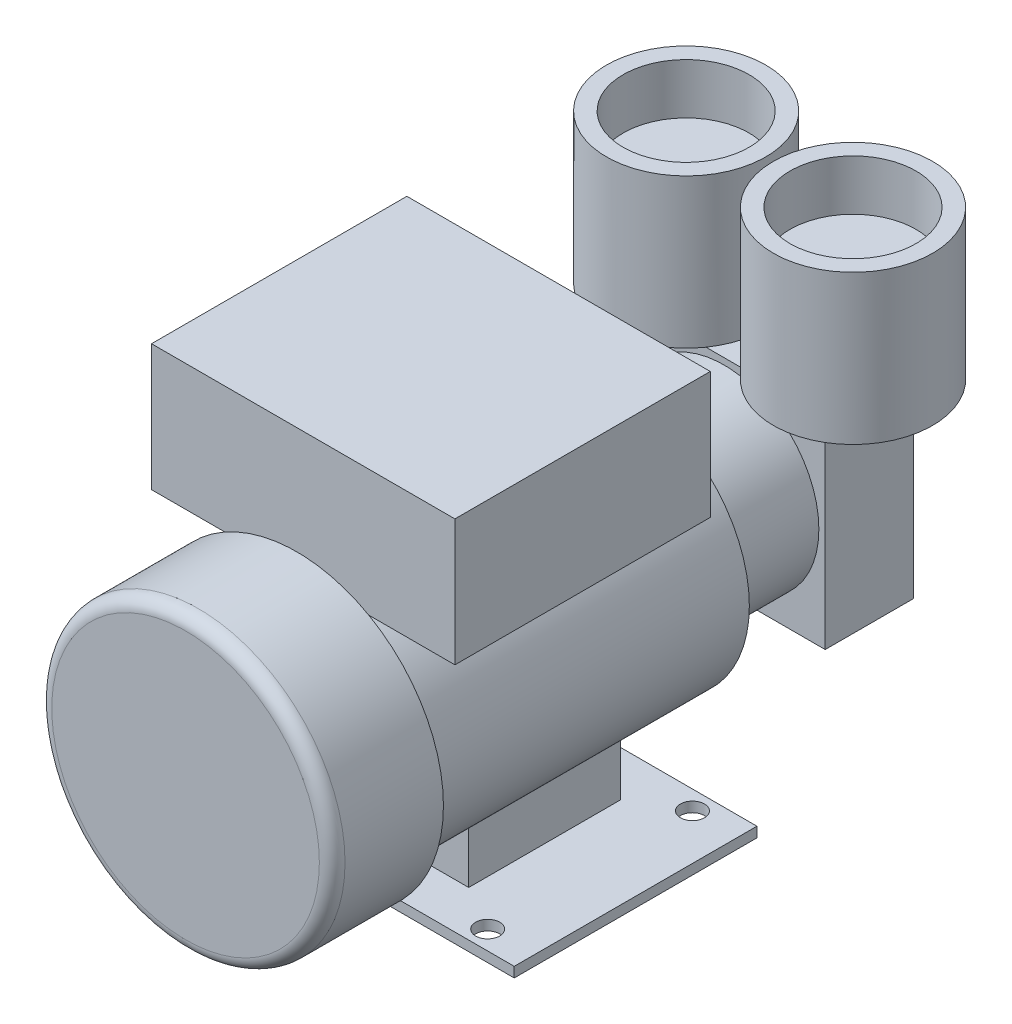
ISO-10303-21;
HEADER;
FILE_DESCRIPTION(('STEP AP214'),'2;1');
FILE_NAME('part.step','',(''),(''),'','','');
FILE_SCHEMA(('AUTOMOTIVE_DESIGN { 1 0 10303 214 1 1 1 1 }'));
ENDSEC;
DATA;
#1=APPLICATION_CONTEXT('core data for automotive mechanical design processes');
#2=APPLICATION_PROTOCOL_DEFINITION('international standard','automotive_design',2000,#1);
#3=PRODUCT_CONTEXT('',#1,'mechanical');
#4=PRODUCT('Part','Part','',(#3));
#5=PRODUCT_RELATED_PRODUCT_CATEGORY('part','',(#4));
#6=PRODUCT_DEFINITION_FORMATION('','',#4);
#7=PRODUCT_DEFINITION_CONTEXT('part definition',#1,'design');
#8=PRODUCT_DEFINITION('design','',#6,#7);
#9=PRODUCT_DEFINITION_SHAPE('','',#8);
#10=(LENGTH_UNIT() NAMED_UNIT(*) SI_UNIT(.MILLI.,.METRE.));
#11=(NAMED_UNIT(*) PLANE_ANGLE_UNIT() SI_UNIT($,.RADIAN.));
#12=(NAMED_UNIT(*) SI_UNIT($,.STERADIAN.) SOLID_ANGLE_UNIT());
#13=UNCERTAINTY_MEASURE_WITH_UNIT(LENGTH_MEASURE(1.E-05),#10,'distance_accuracy_value','');
#14=(GEOMETRIC_REPRESENTATION_CONTEXT(3) GLOBAL_UNCERTAINTY_ASSIGNED_CONTEXT((#13)) GLOBAL_UNIT_ASSIGNED_CONTEXT((#10,
#11,#12)) REPRESENTATION_CONTEXT('',''));
#15=CARTESIAN_POINT('',(0.,0.,0.));
#16=DIRECTION('',(0.,0.,1.));
#17=DIRECTION('',(1.,0.,0.));
#18=AXIS2_PLACEMENT_3D('',#15,#16,#17);
#19=CARTESIAN_POINT('',(40.,40.,-204.));
#20=DIRECTION('',(0.,-1.,0.));
#21=DIRECTION('',(0.,0.,-1.));
#22=AXIS2_PLACEMENT_3D('',#19,#20,#21);
#23=PLANE('',#22);
#24=CARTESIAN_POINT('',(-33.,40.,-187.));
#25=DIRECTION('',(0.,1.,0.));
#26=DIRECTION('',(0.,0.,-1.));
#27=AXIS2_PLACEMENT_3D('',#24,#25,#26);
#28=CIRCLE('',#27,31.5);
#29=CARTESIAN_POINT('',(-7.14946809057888,40.,-169.));
#30=VERTEX_POINT('',#29);
#31=CARTESIAN_POINT('',(-6.48113878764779,40.,-204.));
#32=VERTEX_POINT('',#31);
#33=EDGE_CURVE('E48',#30,#32,#28,.T.);
#34=ORIENTED_EDGE('',*,*,#33,.F.);
#35=DIRECTION('',(1.,0.,0.));
#36=VECTOR('',#35,1.);
#37=CARTESIAN_POINT('',(40.,40.,-169.));
#38=LINE('',#37,#36);
#39=CARTESIAN_POINT('',(7.14946809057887,40.,-169.));
#40=VERTEX_POINT('',#39);
#41=EDGE_CURVE('E182',#30,#40,#38,.T.);
#42=ORIENTED_EDGE('',*,*,#41,.T.);
#43=CARTESIAN_POINT('',(33.,40.,-187.));
#44=DIRECTION('',(0.,1.,0.));
#45=DIRECTION('',(0.,0.,1.));
#46=AXIS2_PLACEMENT_3D('',#43,#44,#45);
#47=CIRCLE('',#46,31.5);
#48=CARTESIAN_POINT('',(6.48113878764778,40.,-204.));
#49=VERTEX_POINT('',#48);
#50=EDGE_CURVE('E508',#49,#40,#47,.T.);
#51=ORIENTED_EDGE('',*,*,#50,.F.);
#52=DIRECTION('',(1.,0.,0.));
#53=VECTOR('',#52,1.);
#54=CARTESIAN_POINT('',(40.,40.,-204.));
#55=LINE('',#54,#53);
#56=EDGE_CURVE('E56',#32,#49,#55,.T.);
#57=ORIENTED_EDGE('',*,*,#56,.F.);
#58=EDGE_LOOP('',(#34,#42,#51,#57));
#59=FACE_BOUND('',#58,.T.);
#60=ADVANCED_FACE('F34',(#59),#23,.F.);
#61=CARTESIAN_POINT('',(66.,-61.,-116.));
#62=DIRECTION('',(0.,-1.,0.));
#63=DIRECTION('',(0.,0.,-1.));
#64=AXIS2_PLACEMENT_3D('',#61,#62,#63);
#65=PLANE('',#64);
#66=CARTESIAN_POINT('',(-48.,-61.,-27.4999999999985));
#67=DIRECTION('',(0.,1.,0.));
#68=DIRECTION('',(0.,0.,1.));
#69=AXIS2_PLACEMENT_3D('',#66,#67,#68);
#70=CIRCLE('',#69,4.75);
#71=CARTESIAN_POINT('',(-48.,-61.,-22.7499999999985));
#72=VERTEX_POINT('',#71);
#73=EDGE_CURVE('E310',#72,#72,#70,.T.);
#74=ORIENTED_EDGE('',*,*,#73,.F.);
#75=EDGE_LOOP('',(#74));
#76=FACE_BOUND('',#75,.T.);
#77=CARTESIAN_POINT('',(-48.,-61.,-108.499999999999));
#78=DIRECTION('',(0.,1.,0.));
#79=DIRECTION('',(0.,0.,1.));
#80=AXIS2_PLACEMENT_3D('',#77,#78,#79);
#81=CIRCLE('',#80,4.75);
#82=CARTESIAN_POINT('',(-48.,-61.,-103.749999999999));
#83=VERTEX_POINT('',#82);
#84=EDGE_CURVE('E322',#83,#83,#81,.T.);
#85=ORIENTED_EDGE('',*,*,#84,.F.);
#86=EDGE_LOOP('',(#85));
#87=FACE_BOUND('',#86,.T.);
#88=DIRECTION('',(0.,0.,-1.));
#89=VECTOR('',#88,1.);
#90=CARTESIAN_POINT('',(66.,-61.,-20.));
#91=LINE('',#90,#89);
#92=CARTESIAN_POINT('',(66.,-61.,-20.));
#93=VERTEX_POINT('',#92);
#94=CARTESIAN_POINT('',(66.,-61.,-116.));
#95=VERTEX_POINT('',#94);
#96=EDGE_CURVE('E334',#93,#95,#91,.T.);
#97=ORIENTED_EDGE('',*,*,#96,.T.);
#98=DIRECTION('',(-1.,0.,0.));
#99=VECTOR('',#98,1.);
#100=CARTESIAN_POINT('',(-66.0000000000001,-61.,-116.));
#101=LINE('',#100,#99);
#102=CARTESIAN_POINT('',(-66.0000000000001,-61.,-116.));
#103=VERTEX_POINT('',#102);
#104=EDGE_CURVE('E337',#95,#103,#101,.T.);
#105=ORIENTED_EDGE('',*,*,#104,.T.);
#106=DIRECTION('',(0.,0.,1.));
#107=VECTOR('',#106,1.);
#108=CARTESIAN_POINT('',(-66.,-61.,-20.));
#109=LINE('',#108,#107);
#110=CARTESIAN_POINT('',(-66.,-61.,-20.));
#111=VERTEX_POINT('',#110);
#112=EDGE_CURVE('E340',#103,#111,#109,.T.);
#113=ORIENTED_EDGE('',*,*,#112,.T.);
#114=DIRECTION('',(1.,0.,0.));
#115=VECTOR('',#114,1.);
#116=CARTESIAN_POINT('',(-66.,-61.,-20.));
#117=LINE('',#116,#115);
#118=EDGE_CURVE('E342',#111,#93,#117,.T.);
#119=ORIENTED_EDGE('',*,*,#118,.T.);
#120=EDGE_LOOP('',(#97,#105,#113,#119));
#121=FACE_BOUND('',#120,.T.);
#122=CARTESIAN_POINT('',(48.,-61.,-108.5));
#123=DIRECTION('',(0.,1.,0.));
#124=DIRECTION('',(0.,0.,1.));
#125=AXIS2_PLACEMENT_3D('',#122,#123,#124);
#126=CIRCLE('',#125,4.75);
#127=CARTESIAN_POINT('',(48.,-61.,-103.75));
#128=VERTEX_POINT('',#127);
#129=EDGE_CURVE('E328',#128,#128,#126,.T.);
#130=ORIENTED_EDGE('',*,*,#129,.F.);
#131=EDGE_LOOP('',(#130));
#132=FACE_BOUND('',#131,.T.);
#133=CARTESIAN_POINT('',(48.,-61.,-27.5));
#134=DIRECTION('',(0.,1.,0.));
#135=DIRECTION('',(0.,0.,1.));
#136=AXIS2_PLACEMENT_3D('',#133,#134,#135);
#137=CIRCLE('',#136,4.75);
#138=CARTESIAN_POINT('',(48.,-61.,-22.75));
#139=VERTEX_POINT('',#138);
#140=EDGE_CURVE('E316',#139,#139,#137,.T.);
#141=ORIENTED_EDGE('',*,*,#140,.F.);
#142=EDGE_LOOP('',(#141));
#143=FACE_BOUND('',#142,.T.);
#144=DIRECTION('',(0.,0.,-1.));
#145=VECTOR('',#144,1.);
#146=CARTESIAN_POINT('',(30.,-61.,-98.));
#147=LINE('',#146,#145);
#148=CARTESIAN_POINT('',(30.,-61.,-38.));
#149=VERTEX_POINT('',#148);
#150=CARTESIAN_POINT('',(30.,-61.,-98.));
#151=VERTEX_POINT('',#150);
#152=EDGE_CURVE('E289',#149,#151,#147,.T.);
#153=ORIENTED_EDGE('',*,*,#152,.F.);
#154=DIRECTION('',(1.,0.,0.));
#155=VECTOR('',#154,1.);
#156=CARTESIAN_POINT('',(-30.,-61.,-38.));
#157=LINE('',#156,#155);
#158=CARTESIAN_POINT('',(-30.,-61.,-38.));
#159=VERTEX_POINT('',#158);
#160=EDGE_CURVE('E298',#159,#149,#157,.T.);
#161=ORIENTED_EDGE('',*,*,#160,.F.);
#162=DIRECTION('',(0.,0.,1.));
#163=VECTOR('',#162,1.);
#164=CARTESIAN_POINT('',(-30.,-61.,-98.));
#165=LINE('',#164,#163);
#166=CARTESIAN_POINT('',(-30.,-61.,-98.));
#167=VERTEX_POINT('',#166);
#168=EDGE_CURVE('E295',#167,#159,#165,.T.);
#169=ORIENTED_EDGE('',*,*,#168,.F.);
#170=DIRECTION('',(-1.,0.,0.));
#171=VECTOR('',#170,1.);
#172=CARTESIAN_POINT('',(-30.,-61.,-98.));
#173=LINE('',#172,#171);
#174=EDGE_CURVE('E292',#151,#167,#173,.T.);
#175=ORIENTED_EDGE('',*,*,#174,.F.);
#176=EDGE_LOOP('',(#153,#161,#169,#175));
#177=FACE_BOUND('',#176,.T.);
#178=ADVANCED_FACE('F381',(#76,#87,#121,#132,#143,#177),#65,.F.);
#179=CARTESIAN_POINT('',(66.,-65.,-116.));
#180=DIRECTION('',(0.,-1.,0.));
#181=DIRECTION('',(0.,0.,-1.));
#182=AXIS2_PLACEMENT_3D('',#179,#180,#181);
#183=PLANE('',#182);
#184=CARTESIAN_POINT('',(48.,-65.,-27.5));
#185=DIRECTION('',(0.,1.,0.));
#186=DIRECTION('',(0.,0.,1.));
#187=AXIS2_PLACEMENT_3D('',#184,#185,#186);
#188=CIRCLE('',#187,4.75);
#189=CARTESIAN_POINT('',(48.,-65.,-22.75));
#190=VERTEX_POINT('',#189);
#191=EDGE_CURVE('E313',#190,#190,#188,.T.);
#192=ORIENTED_EDGE('',*,*,#191,.T.);
#193=EDGE_LOOP('',(#192));
#194=FACE_BOUND('',#193,.T.);
#195=CARTESIAN_POINT('',(48.,-65.,-108.5));
#196=DIRECTION('',(0.,1.,0.));
#197=DIRECTION('',(0.,0.,1.));
#198=AXIS2_PLACEMENT_3D('',#195,#196,#197);
#199=CIRCLE('',#198,4.75);
#200=CARTESIAN_POINT('',(48.,-65.,-103.75));
#201=VERTEX_POINT('',#200);
#202=EDGE_CURVE('E325',#201,#201,#199,.T.);
#203=ORIENTED_EDGE('',*,*,#202,.T.);
#204=EDGE_LOOP('',(#203));
#205=FACE_BOUND('',#204,.T.);
#206=DIRECTION('',(0.,0.,-1.));
#207=VECTOR('',#206,1.);
#208=CARTESIAN_POINT('',(66.,-65.,-20.));
#209=LINE('',#208,#207);
#210=CARTESIAN_POINT('',(66.,-65.,-20.));
#211=VERTEX_POINT('',#210);
#212=CARTESIAN_POINT('',(66.,-65.,-116.));
#213=VERTEX_POINT('',#212);
#214=EDGE_CURVE('E331',#211,#213,#209,.T.);
#215=ORIENTED_EDGE('',*,*,#214,.F.);
#216=DIRECTION('',(1.,0.,0.));
#217=VECTOR('',#216,1.);
#218=CARTESIAN_POINT('',(-66.,-65.,-20.));
#219=LINE('',#218,#217);
#220=CARTESIAN_POINT('',(-66.,-65.,-20.));
#221=VERTEX_POINT('',#220);
#222=EDGE_CURVE('E338',#221,#211,#219,.T.);
#223=ORIENTED_EDGE('',*,*,#222,.F.);
#224=DIRECTION('',(0.,0.,1.));
#225=VECTOR('',#224,1.);
#226=CARTESIAN_POINT('',(-66.,-65.,-20.));
#227=LINE('',#226,#225);
#228=CARTESIAN_POINT('',(-66.0000000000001,-65.,-116.));
#229=VERTEX_POINT('',#228);
#230=EDGE_CURVE('E349',#229,#221,#227,.T.);
#231=ORIENTED_EDGE('',*,*,#230,.F.);
#232=DIRECTION('',(-1.,0.,0.));
#233=VECTOR('',#232,1.);
#234=CARTESIAN_POINT('',(-66.0000000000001,-65.,-116.));
#235=LINE('',#234,#233);
#236=EDGE_CURVE('E347',#213,#229,#235,.T.);
#237=ORIENTED_EDGE('',*,*,#236,.F.);
#238=EDGE_LOOP('',(#215,#223,#231,#237));
#239=FACE_BOUND('',#238,.T.);
#240=CARTESIAN_POINT('',(-48.,-65.,-108.499999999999));
#241=DIRECTION('',(0.,1.,0.));
#242=DIRECTION('',(0.,0.,1.));
#243=AXIS2_PLACEMENT_3D('',#240,#241,#242);
#244=CIRCLE('',#243,4.75);
#245=CARTESIAN_POINT('',(-48.,-65.,-103.749999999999));
#246=VERTEX_POINT('',#245);
#247=EDGE_CURVE('E319',#246,#246,#244,.T.);
#248=ORIENTED_EDGE('',*,*,#247,.T.);
#249=EDGE_LOOP('',(#248));
#250=FACE_BOUND('',#249,.T.);
#251=CARTESIAN_POINT('',(-48.,-65.,-27.4999999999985));
#252=DIRECTION('',(0.,1.,0.));
#253=DIRECTION('',(0.,0.,1.));
#254=AXIS2_PLACEMENT_3D('',#251,#252,#253);
#255=CIRCLE('',#254,4.75);
#256=CARTESIAN_POINT('',(-48.,-65.,-22.7499999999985));
#257=VERTEX_POINT('',#256);
#258=EDGE_CURVE('E309',#257,#257,#255,.T.);
#259=ORIENTED_EDGE('',*,*,#258,.T.);
#260=EDGE_LOOP('',(#259));
#261=FACE_BOUND('',#260,.T.);
#262=ADVANCED_FACE('F370',(#194,#205,#239,#250,#261),#183,.T.);
#263=CARTESIAN_POINT('',(66.,-61.,-20.));
#264=DIRECTION('',(-1.,0.,0.));
#265=DIRECTION('',(0.,0.,1.));
#266=AXIS2_PLACEMENT_3D('',#263,#264,#265);
#267=PLANE('',#266);
#268=ORIENTED_EDGE('',*,*,#214,.T.);
#269=DIRECTION('',(0.,-1.,0.));
#270=VECTOR('',#269,1.);
#271=CARTESIAN_POINT('',(66.,-61.,-116.));
#272=LINE('',#271,#270);
#273=EDGE_CURVE('E42',#95,#213,#272,.T.);
#274=ORIENTED_EDGE('',*,*,#273,.F.);
#275=ORIENTED_EDGE('',*,*,#96,.F.);
#276=DIRECTION('',(0.,-1.,0.));
#277=VECTOR('',#276,1.);
#278=CARTESIAN_POINT('',(66.,-61.,-20.));
#279=LINE('',#278,#277);
#280=EDGE_CURVE('E344',#93,#211,#279,.T.);
#281=ORIENTED_EDGE('',*,*,#280,.T.);
#282=EDGE_LOOP('',(#268,#274,#275,#281));
#283=FACE_BOUND('',#282,.T.);
#284=ADVANCED_FACE('F36',(#283),#267,.F.);
#285=CARTESIAN_POINT('',(-66.0000000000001,-61.,-116.));
#286=DIRECTION('',(0.,0.,1.));
#287=DIRECTION('',(1.,0.,0.));
#288=AXIS2_PLACEMENT_3D('',#285,#286,#287);
#289=PLANE('',#288);
#290=ORIENTED_EDGE('',*,*,#236,.T.);
#291=DIRECTION('',(0.,-1.,0.));
#292=VECTOR('',#291,1.);
#293=CARTESIAN_POINT('',(-66.0000000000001,-61.,-116.));
#294=LINE('',#293,#292);
#295=EDGE_CURVE('E357',#103,#229,#294,.T.);
#296=ORIENTED_EDGE('',*,*,#295,.F.);
#297=ORIENTED_EDGE('',*,*,#104,.F.);
#298=ORIENTED_EDGE('',*,*,#273,.T.);
#299=EDGE_LOOP('',(#290,#296,#297,#298));
#300=FACE_BOUND('',#299,.T.);
#301=ADVANCED_FACE('F362',(#300),#289,.F.);
#302=CARTESIAN_POINT('',(-66.,-61.,-20.));
#303=DIRECTION('',(1.,0.,0.));
#304=DIRECTION('',(0.,0.,-1.));
#305=AXIS2_PLACEMENT_3D('',#302,#303,#304);
#306=PLANE('',#305);
#307=ORIENTED_EDGE('',*,*,#230,.T.);
#308=DIRECTION('',(0.,-1.,0.));
#309=VECTOR('',#308,1.);
#310=CARTESIAN_POINT('',(-66.,-61.,-20.));
#311=LINE('',#310,#309);
#312=EDGE_CURVE('E354',#111,#221,#311,.T.);
#313=ORIENTED_EDGE('',*,*,#312,.F.);
#314=ORIENTED_EDGE('',*,*,#112,.F.);
#315=ORIENTED_EDGE('',*,*,#295,.T.);
#316=EDGE_LOOP('',(#307,#313,#314,#315));
#317=FACE_BOUND('',#316,.T.);
#318=ADVANCED_FACE('F375',(#317),#306,.F.);
#319=CARTESIAN_POINT('',(-66.,-61.,-20.));
#320=DIRECTION('',(0.,0.,-1.));
#321=DIRECTION('',(-1.,0.,0.));
#322=AXIS2_PLACEMENT_3D('',#319,#320,#321);
#323=PLANE('',#322);
#324=ORIENTED_EDGE('',*,*,#222,.T.);
#325=ORIENTED_EDGE('',*,*,#280,.F.);
#326=ORIENTED_EDGE('',*,*,#118,.F.);
#327=ORIENTED_EDGE('',*,*,#312,.T.);
#328=EDGE_LOOP('',(#324,#325,#326,#327));
#329=FACE_BOUND('',#328,.T.);
#330=ADVANCED_FACE('F379',(#329),#323,.F.);
#331=CARTESIAN_POINT('',(48.,-61.,-108.5));
#332=DIRECTION('',(0.,-1.,0.));
#333=DIRECTION('',(0.,0.,-1.));
#334=AXIS2_PLACEMENT_3D('',#331,#332,#333);
#335=CYLINDRICAL_SURFACE('',#334,4.75);
#336=ORIENTED_EDGE('',*,*,#129,.T.);
#337=EDGE_LOOP('',(#336));
#338=FACE_BOUND('',#337,.T.);
#339=ORIENTED_EDGE('',*,*,#202,.F.);
#340=EDGE_LOOP('',(#339));
#341=FACE_BOUND('',#340,.T.);
#342=ADVANCED_FACE('F795',(#338,#341),#335,.F.);
#343=CARTESIAN_POINT('',(-48.,-61.,-108.499999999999));
#344=DIRECTION('',(0.,-1.,0.));
#345=DIRECTION('',(0.,0.,-1.));
#346=AXIS2_PLACEMENT_3D('',#343,#344,#345);
#347=CYLINDRICAL_SURFACE('',#346,4.75);
#348=ORIENTED_EDGE('',*,*,#84,.T.);
#349=EDGE_LOOP('',(#348));
#350=FACE_BOUND('',#349,.T.);
#351=ORIENTED_EDGE('',*,*,#247,.F.);
#352=EDGE_LOOP('',(#351));
#353=FACE_BOUND('',#352,.T.);
#354=ADVANCED_FACE('F786',(#350,#353),#347,.F.);
#355=CARTESIAN_POINT('',(48.,-61.,-27.5));
#356=DIRECTION('',(0.,-1.,0.));
#357=DIRECTION('',(0.,0.,-1.));
#358=AXIS2_PLACEMENT_3D('',#355,#356,#357);
#359=CYLINDRICAL_SURFACE('',#358,4.75);
#360=ORIENTED_EDGE('',*,*,#140,.T.);
#361=EDGE_LOOP('',(#360));
#362=FACE_BOUND('',#361,.T.);
#363=ORIENTED_EDGE('',*,*,#191,.F.);
#364=EDGE_LOOP('',(#363));
#365=FACE_BOUND('',#364,.T.);
#366=ADVANCED_FACE('F777',(#362,#365),#359,.F.);
#367=CARTESIAN_POINT('',(-48.,-61.,-27.4999999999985));
#368=DIRECTION('',(0.,-1.,0.));
#369=DIRECTION('',(0.,0.,-1.));
#370=AXIS2_PLACEMENT_3D('',#367,#368,#369);
#371=CYLINDRICAL_SURFACE('',#370,4.75);
#372=ORIENTED_EDGE('',*,*,#73,.T.);
#373=EDGE_LOOP('',(#372));
#374=FACE_BOUND('',#373,.T.);
#375=ORIENTED_EDGE('',*,*,#258,.F.);
#376=EDGE_LOOP('',(#375));
#377=FACE_BOUND('',#376,.T.);
#378=ADVANCED_FACE('F672',(#374,#377),#371,.F.);
#379=CARTESIAN_POINT('',(30.,-36.,-98.));
#380=DIRECTION('',(-1.,0.,0.));
#381=DIRECTION('',(0.,0.,1.));
#382=AXIS2_PLACEMENT_3D('',#379,#380,#381);
#383=PLANE('',#382);
#384=DIRECTION('',(0.,-1.,0.));
#385=VECTOR('',#384,1.);
#386=CARTESIAN_POINT('',(30.,-36.,-98.));
#387=LINE('',#386,#385);
#388=CARTESIAN_POINT('',(30.,-40.,-98.));
#389=VERTEX_POINT('',#388);
#390=EDGE_CURVE('E307',#389,#151,#387,.T.);
#391=ORIENTED_EDGE('',*,*,#390,.F.);
#392=DIRECTION('',(0.,0.,1.));
#393=VECTOR('',#392,1.);
#394=CARTESIAN_POINT('',(30.,-40.,-129.));
#395=LINE('',#394,#393);
#396=CARTESIAN_POINT('',(30.,-40.,-38.));
#397=VERTEX_POINT('',#396);
#398=EDGE_CURVE('E286',#389,#397,#395,.T.);
#399=ORIENTED_EDGE('',*,*,#398,.T.);
#400=DIRECTION('',(0.,-1.,0.));
#401=VECTOR('',#400,1.);
#402=CARTESIAN_POINT('',(30.,-36.,-38.));
#403=LINE('',#402,#401);
#404=EDGE_CURVE('E301',#397,#149,#403,.T.);
#405=ORIENTED_EDGE('',*,*,#404,.T.);
#406=ORIENTED_EDGE('',*,*,#152,.T.);
#407=EDGE_LOOP('',(#391,#399,#405,#406));
#408=FACE_BOUND('',#407,.T.);
#409=ADVANCED_FACE('F405',(#408),#383,.F.);
#410=CARTESIAN_POINT('',(-30.,-36.,-98.));
#411=DIRECTION('',(0.,0.,1.));
#412=DIRECTION('',(1.,0.,0.));
#413=AXIS2_PLACEMENT_3D('',#410,#411,#412);
#414=PLANE('',#413);
#415=DIRECTION('',(0.,-1.,0.));
#416=VECTOR('',#415,1.);
#417=CARTESIAN_POINT('',(-30.,-36.,-98.));
#418=LINE('',#417,#416);
#419=CARTESIAN_POINT('',(-30.,-40.,-98.));
#420=VERTEX_POINT('',#419);
#421=EDGE_CURVE('E305',#420,#167,#418,.T.);
#422=ORIENTED_EDGE('',*,*,#421,.F.);
#423=CARTESIAN_POINT('',(0.,0.,-98.));
#424=DIRECTION('',(0.,0.,1.));
#425=DIRECTION('',(1.,0.,0.));
#426=AXIS2_PLACEMENT_3D('',#423,#424,#425);
#427=CIRCLE('',#426,50.);
#428=EDGE_CURVE('E283',#420,#389,#427,.T.);
#429=ORIENTED_EDGE('',*,*,#428,.T.);
#430=ORIENTED_EDGE('',*,*,#390,.T.);
#431=ORIENTED_EDGE('',*,*,#174,.T.);
#432=EDGE_LOOP('',(#422,#429,#430,#431));
#433=FACE_BOUND('',#432,.T.);
#434=ADVANCED_FACE('F404',(#433),#414,.F.);
#435=CARTESIAN_POINT('',(-30.,-36.,-98.));
#436=DIRECTION('',(1.,0.,0.));
#437=DIRECTION('',(0.,0.,-1.));
#438=AXIS2_PLACEMENT_3D('',#435,#436,#437);
#439=PLANE('',#438);
#440=DIRECTION('',(0.,-1.,0.));
#441=VECTOR('',#440,1.);
#442=CARTESIAN_POINT('',(-30.,-36.,-38.));
#443=LINE('',#442,#441);
#444=CARTESIAN_POINT('',(-30.,-40.,-38.));
#445=VERTEX_POINT('',#444);
#446=EDGE_CURVE('E303',#445,#159,#443,.T.);
#447=ORIENTED_EDGE('',*,*,#446,.F.);
#448=DIRECTION('',(0.,0.,1.));
#449=VECTOR('',#448,1.);
#450=CARTESIAN_POINT('',(-30.,-40.,-129.));
#451=LINE('',#450,#449);
#452=EDGE_CURVE('E280',#445,#420,#451,.F.);
#453=ORIENTED_EDGE('',*,*,#452,.T.);
#454=ORIENTED_EDGE('',*,*,#421,.T.);
#455=ORIENTED_EDGE('',*,*,#168,.T.);
#456=EDGE_LOOP('',(#447,#453,#454,#455));
#457=FACE_BOUND('',#456,.T.);
#458=ADVANCED_FACE('F401',(#457),#439,.F.);
#459=CARTESIAN_POINT('',(-30.,-36.,-38.));
#460=DIRECTION('',(0.,0.,-1.));
#461=DIRECTION('',(-1.,0.,0.));
#462=AXIS2_PLACEMENT_3D('',#459,#460,#461);
#463=PLANE('',#462);
#464=ORIENTED_EDGE('',*,*,#404,.F.);
#465=CARTESIAN_POINT('',(0.,0.,-38.));
#466=DIRECTION('',(0.,0.,-1.));
#467=DIRECTION('',(-1.,0.,0.));
#468=AXIS2_PLACEMENT_3D('',#465,#466,#467);
#469=CIRCLE('',#468,50.);
#470=EDGE_CURVE('E11',#397,#445,#469,.T.);
#471=ORIENTED_EDGE('',*,*,#470,.T.);
#472=ORIENTED_EDGE('',*,*,#446,.T.);
#473=ORIENTED_EDGE('',*,*,#160,.T.);
#474=EDGE_LOOP('',(#464,#471,#472,#473));
#475=FACE_BOUND('',#474,.T.);
#476=ADVANCED_FACE('F398',(#475),#463,.F.);
#477=CARTESIAN_POINT('',(0.,0.,-129.));
#478=DIRECTION('',(0.,0.,1.));
#479=DIRECTION('',(1.,0.,0.));
#480=AXIS2_PLACEMENT_3D('',#477,#478,#479);
#481=CYLINDRICAL_SURFACE('',#480,50.);
#482=CARTESIAN_POINT('',(0.,0.,-2.53999999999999));
#483=DIRECTION('',(0.,0.,-1.));
#484=DIRECTION('',(-1.,0.,0.));
#485=AXIS2_PLACEMENT_3D('',#482,#483,#484);
#486=CIRCLE('',#485,50.);
#487=CARTESIAN_POINT('',(13.9999999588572,48.000000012,-2.53999999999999));
#488=VERTEX_POINT('',#487);
#489=CARTESIAN_POINT('',(-13.9999999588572,48.000000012,-2.53999999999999));
#490=VERTEX_POINT('',#489);
#491=EDGE_CURVE('E265',#488,#490,#486,.F.);
#492=ORIENTED_EDGE('',*,*,#491,.T.);
#493=DIRECTION('',(0.,0.,1.));
#494=VECTOR('',#493,1.);
#495=CARTESIAN_POINT('',(-13.9999999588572,48.000000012,-129.));
#496=LINE('',#495,#494);
#497=CARTESIAN_POINT('',(-13.9999999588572,48.000000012,-103.54));
#498=VERTEX_POINT('',#497);
#499=EDGE_CURVE('E271',#490,#498,#496,.F.);
#500=ORIENTED_EDGE('',*,*,#499,.T.);
#501=CARTESIAN_POINT('',(0.,0.,-103.54));
#502=DIRECTION('',(0.,0.,1.));
#503=DIRECTION('',(1.,0.,0.));
#504=AXIS2_PLACEMENT_3D('',#501,#502,#503);
#505=CIRCLE('',#504,50.);
#506=CARTESIAN_POINT('',(13.9999999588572,48.000000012,-103.54));
#507=VERTEX_POINT('',#506);
#508=EDGE_CURVE('E268',#498,#507,#505,.F.);
#509=ORIENTED_EDGE('',*,*,#508,.T.);
#510=DIRECTION('',(0.,0.,1.));
#511=VECTOR('',#510,1.);
#512=CARTESIAN_POINT('',(13.9999999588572,48.000000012,-129.));
#513=LINE('',#512,#511);
#514=EDGE_CURVE('E262',#507,#488,#513,.T.);
#515=ORIENTED_EDGE('',*,*,#514,.T.);
#516=EDGE_LOOP('',(#492,#500,#509,#515));
#517=FACE_BOUND('',#516,.T.);
#518=CARTESIAN_POINT('',(0.,0.,-129.));
#519=DIRECTION('',(0.,0.,1.));
#520=DIRECTION('',(1.,0.,0.));
#521=AXIS2_PLACEMENT_3D('',#518,#519,#520);
#522=CIRCLE('',#521,50.);
#523=CARTESIAN_POINT('',(50.,0.,-129.));
#524=VERTEX_POINT('',#523);
#525=EDGE_CURVE('E254',#524,#524,#522,.T.);
#526=ORIENTED_EDGE('',*,*,#525,.T.);
#527=EDGE_LOOP('',(#526));
#528=FACE_BOUND('',#527,.T.);
#529=CARTESIAN_POINT('',(0.,0.,0.));
#530=DIRECTION('',(0.,0.,1.));
#531=DIRECTION('',(1.,0.,0.));
#532=AXIS2_PLACEMENT_3D('',#529,#530,#531);
#533=CIRCLE('',#532,50.);
#534=CARTESIAN_POINT('',(50.,0.,0.));
#535=VERTEX_POINT('',#534);
#536=EDGE_CURVE('E253',#535,#535,#533,.T.);
#537=ORIENTED_EDGE('',*,*,#536,.F.);
#538=EDGE_LOOP('',(#537));
#539=FACE_BOUND('',#538,.T.);
#540=ORIENTED_EDGE('',*,*,#398,.F.);
#541=ORIENTED_EDGE('',*,*,#428,.F.);
#542=ORIENTED_EDGE('',*,*,#452,.F.);
#543=ORIENTED_EDGE('',*,*,#470,.F.);
#544=EDGE_LOOP('',(#540,#541,#542,#543));
#545=FACE_BOUND('',#544,.T.);
#546=ADVANCED_FACE('F407',(#517,#528,#539,#545),#481,.T.);
#547=CARTESIAN_POINT('',(0.,0.,-129.));
#548=DIRECTION('',(0.,0.,1.));
#549=DIRECTION('',(1.,0.,0.));
#550=AXIS2_PLACEMENT_3D('',#547,#548,#549);
#551=PLANE('',#550);
#552=ORIENTED_EDGE('',*,*,#525,.F.);
#553=EDGE_LOOP('',(#552));
#554=FACE_BOUND('',#553,.T.);
#555=CARTESIAN_POINT('',(0.,0.,-129.));
#556=DIRECTION('',(0.,0.,1.));
#557=DIRECTION('',(1.,0.,0.));
#558=AXIS2_PLACEMENT_3D('',#555,#556,#557);
#559=CIRCLE('',#558,37.5);
#560=CARTESIAN_POINT('',(37.5,0.,-129.));
#561=VERTEX_POINT('',#560);
#562=EDGE_CURVE('E257',#561,#561,#559,.F.);
#563=ORIENTED_EDGE('',*,*,#562,.F.);
#564=EDGE_LOOP('',(#563));
#565=FACE_BOUND('',#564,.T.);
#566=ADVANCED_FACE('F409',(#554,#565),#551,.F.);
#567=CARTESIAN_POINT('',(0.,0.,-169.));
#568=DIRECTION('',(0.,0.,1.));
#569=DIRECTION('',(1.,0.,0.));
#570=AXIS2_PLACEMENT_3D('',#567,#568,#569);
#571=CYLINDRICAL_SURFACE('',#570,37.5);
#572=CARTESIAN_POINT('',(0.,0.,-169.));
#573=DIRECTION('',(0.,0.,-1.));
#574=DIRECTION('',(-1.,0.,0.));
#575=AXIS2_PLACEMENT_3D('',#572,#573,#574);
#576=CIRCLE('',#575,37.5);
#577=CARTESIAN_POINT('',(-37.5,0.,-169.));
#578=VERTEX_POINT('',#577);
#579=EDGE_CURVE('E250',#578,#578,#576,.T.);
#580=ORIENTED_EDGE('',*,*,#579,.F.);
#581=EDGE_LOOP('',(#580));
#582=FACE_BOUND('',#581,.T.);
#583=ORIENTED_EDGE('',*,*,#562,.T.);
#584=EDGE_LOOP('',(#583));
#585=FACE_BOUND('',#584,.T.);
#586=ADVANCED_FACE('F416',(#582,#585),#571,.T.);
#587=CARTESIAN_POINT('',(60.,48.000000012,-103.54));
#588=DIRECTION('',(0.,1.,0.));
#589=DIRECTION('',(0.,0.,1.));
#590=AXIS2_PLACEMENT_3D('',#587,#588,#589);
#591=PLANE('',#590);
#592=ORIENTED_EDGE('',*,*,#499,.F.);
#593=DIRECTION('',(1.,0.,0.));
#594=VECTOR('',#593,1.);
#595=CARTESIAN_POINT('',(-60.,48.000000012,-2.53999999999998));
#596=LINE('',#595,#594);
#597=CARTESIAN_POINT('',(-60.,48.000000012,-2.53999999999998));
#598=VERTEX_POINT('',#597);
#599=EDGE_CURVE('E235',#598,#490,#596,.T.);
#600=ORIENTED_EDGE('',*,*,#599,.F.);
#601=DIRECTION('',(0.,0.,1.));
#602=VECTOR('',#601,1.);
#603=CARTESIAN_POINT('',(-60.,48.000000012,-2.53999999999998));
#604=LINE('',#603,#602);
#605=CARTESIAN_POINT('',(-60.,48.000000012,-103.54));
#606=VERTEX_POINT('',#605);
#607=EDGE_CURVE('E232',#606,#598,#604,.T.);
#608=ORIENTED_EDGE('',*,*,#607,.F.);
#609=DIRECTION('',(-1.,0.,0.));
#610=VECTOR('',#609,1.);
#611=CARTESIAN_POINT('',(-60.,48.000000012,-103.54));
#612=LINE('',#611,#610);
#613=EDGE_CURVE('E217',#498,#606,#612,.T.);
#614=ORIENTED_EDGE('',*,*,#613,.F.);
#615=EDGE_LOOP('',(#592,#600,#608,#614));
#616=FACE_BOUND('',#615,.T.);
#617=ADVANCED_FACE('F456',(#616),#591,.F.);
#618=CARTESIAN_POINT('',(-60.,98.000000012,-103.54));
#619=DIRECTION('',(0.,0.,1.));
#620=DIRECTION('',(1.,0.,0.));
#621=AXIS2_PLACEMENT_3D('',#618,#619,#620);
#622=PLANE('',#621);
#623=ORIENTED_EDGE('',*,*,#508,.F.);
#624=ORIENTED_EDGE('',*,*,#613,.T.);
#625=DIRECTION('',(0.,-1.,0.));
#626=VECTOR('',#625,1.);
#627=CARTESIAN_POINT('',(-60.,98.000000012,-103.54));
#628=LINE('',#627,#626);
#629=CARTESIAN_POINT('',(-60.,98.000000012,-103.54));
#630=VERTEX_POINT('',#629);
#631=EDGE_CURVE('E247',#630,#606,#628,.T.);
#632=ORIENTED_EDGE('',*,*,#631,.F.);
#633=DIRECTION('',(-1.,0.,0.));
#634=VECTOR('',#633,1.);
#635=CARTESIAN_POINT('',(-60.,98.000000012,-103.54));
#636=LINE('',#635,#634);
#637=CARTESIAN_POINT('',(60.,98.000000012,-103.54));
#638=VERTEX_POINT('',#637);
#639=EDGE_CURVE('E218',#638,#630,#636,.T.);
#640=ORIENTED_EDGE('',*,*,#639,.F.);
#641=DIRECTION('',(0.,-1.,0.));
#642=VECTOR('',#641,1.);
#643=CARTESIAN_POINT('',(60.,98.000000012,-103.54));
#644=LINE('',#643,#642);
#645=CARTESIAN_POINT('',(60.,48.000000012,-103.54));
#646=VERTEX_POINT('',#645);
#647=EDGE_CURVE('E228',#638,#646,#644,.T.);
#648=ORIENTED_EDGE('',*,*,#647,.T.);
#649=EDGE_CURVE('E229',#646,#507,#612,.T.);
#650=ORIENTED_EDGE('',*,*,#649,.T.);
#651=EDGE_LOOP('',(#623,#624,#632,#640,#648,#650));
#652=FACE_BOUND('',#651,.T.);
#653=ADVANCED_FACE('F467',(#652),#622,.F.);
#654=CARTESIAN_POINT('',(-60.,98.000000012,-2.53999999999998));
#655=DIRECTION('',(1.,0.,0.));
#656=DIRECTION('',(0.,0.,-1.));
#657=AXIS2_PLACEMENT_3D('',#654,#655,#656);
#658=PLANE('',#657);
#659=ORIENTED_EDGE('',*,*,#607,.T.);
#660=DIRECTION('',(0.,-1.,0.));
#661=VECTOR('',#660,1.);
#662=CARTESIAN_POINT('',(-60.,98.000000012,-2.53999999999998));
#663=LINE('',#662,#661);
#664=CARTESIAN_POINT('',(-60.,98.000000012,-2.53999999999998));
#665=VERTEX_POINT('',#664);
#666=EDGE_CURVE('E244',#665,#598,#663,.T.);
#667=ORIENTED_EDGE('',*,*,#666,.F.);
#668=DIRECTION('',(0.,0.,1.));
#669=VECTOR('',#668,1.);
#670=CARTESIAN_POINT('',(-60.,98.000000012,-2.53999999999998));
#671=LINE('',#670,#669);
#672=EDGE_CURVE('E221',#630,#665,#671,.T.);
#673=ORIENTED_EDGE('',*,*,#672,.F.);
#674=ORIENTED_EDGE('',*,*,#631,.T.);
#675=EDGE_LOOP('',(#659,#667,#673,#674));
#676=FACE_BOUND('',#675,.T.);
#677=ADVANCED_FACE('F463',(#676),#658,.F.);
#678=CARTESIAN_POINT('',(-60.,98.000000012,-2.53999999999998));
#679=DIRECTION('',(0.,0.,-1.));
#680=DIRECTION('',(-1.,0.,0.));
#681=AXIS2_PLACEMENT_3D('',#678,#679,#680);
#682=PLANE('',#681);
#683=ORIENTED_EDGE('',*,*,#491,.F.);
#684=CARTESIAN_POINT('',(60.,48.000000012,-2.54));
#685=VERTEX_POINT('',#684);
#686=EDGE_CURVE('E234',#488,#685,#596,.T.);
#687=ORIENTED_EDGE('',*,*,#686,.T.);
#688=DIRECTION('',(0.,-1.,0.));
#689=VECTOR('',#688,1.);
#690=CARTESIAN_POINT('',(60.,98.000000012,-2.54));
#691=LINE('',#690,#689);
#692=CARTESIAN_POINT('',(60.,98.000000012,-2.54));
#693=VERTEX_POINT('',#692);
#694=EDGE_CURVE('E241',#693,#685,#691,.T.);
#695=ORIENTED_EDGE('',*,*,#694,.F.);
#696=DIRECTION('',(1.,0.,0.));
#697=VECTOR('',#696,1.);
#698=CARTESIAN_POINT('',(-60.,98.000000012,-2.53999999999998));
#699=LINE('',#698,#697);
#700=EDGE_CURVE('E224',#665,#693,#699,.T.);
#701=ORIENTED_EDGE('',*,*,#700,.F.);
#702=ORIENTED_EDGE('',*,*,#666,.T.);
#703=ORIENTED_EDGE('',*,*,#599,.T.);
#704=EDGE_LOOP('',(#683,#687,#695,#701,#702,#703));
#705=FACE_BOUND('',#704,.T.);
#706=ADVANCED_FACE('F459',(#705),#682,.F.);
#707=CARTESIAN_POINT('',(60.,98.000000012,-2.54));
#708=DIRECTION('',(-1.,0.,0.));
#709=DIRECTION('',(0.,0.,1.));
#710=AXIS2_PLACEMENT_3D('',#707,#708,#709);
#711=PLANE('',#710);
#712=DIRECTION('',(0.,0.,-1.));
#713=VECTOR('',#712,1.);
#714=CARTESIAN_POINT('',(60.,48.000000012,-2.54));
#715=LINE('',#714,#713);
#716=EDGE_CURVE('E222',#685,#646,#715,.T.);
#717=ORIENTED_EDGE('',*,*,#716,.T.);
#718=ORIENTED_EDGE('',*,*,#647,.F.);
#719=DIRECTION('',(0.,0.,-1.));
#720=VECTOR('',#719,1.);
#721=CARTESIAN_POINT('',(60.,98.000000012,-2.54));
#722=LINE('',#721,#720);
#723=EDGE_CURVE('E226',#693,#638,#722,.T.);
#724=ORIENTED_EDGE('',*,*,#723,.F.);
#725=ORIENTED_EDGE('',*,*,#694,.T.);
#726=EDGE_LOOP('',(#717,#718,#724,#725));
#727=FACE_BOUND('',#726,.T.);
#728=ADVANCED_FACE('F451',(#727),#711,.F.);
#729=CARTESIAN_POINT('',(60.,98.000000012,-103.54));
#730=DIRECTION('',(0.,1.,0.));
#731=DIRECTION('',(0.,0.,1.));
#732=AXIS2_PLACEMENT_3D('',#729,#730,#731);
#733=PLANE('',#732);
#734=ORIENTED_EDGE('',*,*,#639,.T.);
#735=ORIENTED_EDGE('',*,*,#672,.T.);
#736=ORIENTED_EDGE('',*,*,#700,.T.);
#737=ORIENTED_EDGE('',*,*,#723,.T.);
#738=EDGE_LOOP('',(#734,#735,#736,#737));
#739=FACE_BOUND('',#738,.T.);
#740=ADVANCED_FACE('F448',(#739),#733,.T.);
#741=ORIENTED_EDGE('',*,*,#514,.F.);
#742=ORIENTED_EDGE('',*,*,#649,.F.);
#743=ORIENTED_EDGE('',*,*,#716,.F.);
#744=ORIENTED_EDGE('',*,*,#686,.F.);
#745=EDGE_LOOP('',(#741,#742,#743,#744));
#746=FACE_BOUND('',#745,.T.);
#747=ADVANCED_FACE('F446',(#746),#591,.F.);
#748=CARTESIAN_POINT('',(0.,0.,44.));
#749=DIRECTION('',(0.,0.,-1.));
#750=DIRECTION('',(-1.,0.,0.));
#751=AXIS2_PLACEMENT_3D('',#748,#749,#750);
#752=CYLINDRICAL_SURFACE('',#751,58.);
#753=CARTESIAN_POINT('',(0.,0.,38.92));
#754=DIRECTION('',(0.,0.,1.));
#755=DIRECTION('',(1.,0.,0.));
#756=AXIS2_PLACEMENT_3D('',#753,#754,#755);
#757=CIRCLE('',#756,58.);
#758=CARTESIAN_POINT('',(58.,0.,38.92));
#759=VERTEX_POINT('',#758);
#760=EDGE_CURVE('E277',#759,#759,#757,.F.);
#761=ORIENTED_EDGE('',*,*,#760,.T.);
#762=EDGE_LOOP('',(#761));
#763=FACE_BOUND('',#762,.T.);
#764=CARTESIAN_POINT('',(0.,0.,0.));
#765=DIRECTION('',(0.,0.,1.));
#766=DIRECTION('',(1.,0.,0.));
#767=AXIS2_PLACEMENT_3D('',#764,#765,#766);
#768=CIRCLE('',#767,58.);
#769=CARTESIAN_POINT('',(58.,0.,0.));
#770=VERTEX_POINT('',#769);
#771=EDGE_CURVE('E214',#770,#770,#768,.T.);
#772=ORIENTED_EDGE('',*,*,#771,.T.);
#773=EDGE_LOOP('',(#772));
#774=FACE_BOUND('',#773,.T.);
#775=ADVANCED_FACE('F438',(#763,#774),#752,.T.);
#776=CARTESIAN_POINT('',(0.,0.,44.));
#777=DIRECTION('',(0.,0.,1.));
#778=DIRECTION('',(1.,0.,0.));
#779=AXIS2_PLACEMENT_3D('',#776,#777,#778);
#780=PLANE('',#779);
#781=CARTESIAN_POINT('',(0.,0.,44.));
#782=DIRECTION('',(0.,0.,1.));
#783=DIRECTION('',(1.,0.,0.));
#784=AXIS2_PLACEMENT_3D('',#781,#782,#783);
#785=CIRCLE('',#784,52.92);
#786=CARTESIAN_POINT('',(52.92,0.,44.));
#787=VERTEX_POINT('',#786);
#788=EDGE_CURVE('E274',#787,#787,#785,.T.);
#789=ORIENTED_EDGE('',*,*,#788,.T.);
#790=EDGE_LOOP('',(#789));
#791=FACE_BOUND('',#790,.T.);
#792=ADVANCED_FACE('F434',(#791),#780,.T.);
#793=CARTESIAN_POINT('',(0.,0.,0.));
#794=DIRECTION('',(0.,0.,1.));
#795=DIRECTION('',(1.,0.,0.));
#796=AXIS2_PLACEMENT_3D('',#793,#794,#795);
#797=PLANE('',#796);
#798=ORIENTED_EDGE('',*,*,#536,.T.);
#799=EDGE_LOOP('',(#798));
#800=FACE_BOUND('',#799,.T.);
#801=ORIENTED_EDGE('',*,*,#771,.F.);
#802=EDGE_LOOP('',(#801));
#803=FACE_BOUND('',#802,.T.);
#804=ADVANCED_FACE('F437',(#800,#803),#797,.F.);
#805=CARTESIAN_POINT('',(0.,0.,38.92));
#806=DIRECTION('',(0.,0.,1.));
#807=DIRECTION('',(1.,0.,0.));
#808=AXIS2_PLACEMENT_3D('',#805,#806,#807);
#809=TOROIDAL_SURFACE('',#808,52.92,5.08);
#810=ORIENTED_EDGE('',*,*,#760,.F.);
#811=EDGE_LOOP('',(#810));
#812=FACE_BOUND('',#811,.T.);
#813=ORIENTED_EDGE('',*,*,#788,.F.);
#814=EDGE_LOOP('',(#813));
#815=FACE_BOUND('',#814,.T.);
#816=ADVANCED_FACE('F442',(#812,#815),#809,.T.);
#817=CARTESIAN_POINT('',(-40.,-40.,-169.));
#818=DIRECTION('',(0.,0.,-1.));
#819=DIRECTION('',(-1.,0.,0.));
#820=AXIS2_PLACEMENT_3D('',#817,#818,#819);
#821=PLANE('',#820);
#822=DIRECTION('',(0.,1.,0.));
#823=VECTOR('',#822,1.);
#824=CARTESIAN_POINT('',(-40.,40.,-169.));
#825=LINE('',#824,#823);
#826=CARTESIAN_POINT('',(-40.,-40.,-169.));
#827=VERTEX_POINT('',#826);
#828=CARTESIAN_POINT('',(-40.,40.,-169.));
#829=VERTEX_POINT('',#828);
#830=EDGE_CURVE('E196',#827,#829,#825,.T.);
#831=ORIENTED_EDGE('',*,*,#830,.F.);
#832=DIRECTION('',(-1.,0.,0.));
#833=VECTOR('',#832,1.);
#834=CARTESIAN_POINT('',(40.,-40.,-169.));
#835=LINE('',#834,#833);
#836=CARTESIAN_POINT('',(40.,-40.,-169.));
#837=VERTEX_POINT('',#836);
#838=EDGE_CURVE('E201',#837,#827,#835,.T.);
#839=ORIENTED_EDGE('',*,*,#838,.F.);
#840=DIRECTION('',(0.,-1.,0.));
#841=VECTOR('',#840,1.);
#842=CARTESIAN_POINT('',(40.,40.,-169.));
#843=LINE('',#842,#841);
#844=CARTESIAN_POINT('',(40.,40.,-169.));
#845=VERTEX_POINT('',#844);
#846=EDGE_CURVE('E181',#845,#837,#843,.T.);
#847=ORIENTED_EDGE('',*,*,#846,.F.);
#848=EDGE_CURVE('E184',#40,#845,#38,.T.);
#849=ORIENTED_EDGE('',*,*,#848,.F.);
#850=ORIENTED_EDGE('',*,*,#41,.F.);
#851=EDGE_CURVE('E172',#829,#30,#38,.T.);
#852=ORIENTED_EDGE('',*,*,#851,.F.);
#853=EDGE_LOOP('',(#831,#839,#847,#849,#850,#852));
#854=FACE_BOUND('',#853,.T.);
#855=ORIENTED_EDGE('',*,*,#579,.T.);
#856=EDGE_LOOP('',(#855));
#857=FACE_BOUND('',#856,.T.);
#858=ADVANCED_FACE('F191',(#854,#857),#821,.F.);
#859=CARTESIAN_POINT('',(-40.,40.,-204.));
#860=DIRECTION('',(1.,0.,0.));
#861=DIRECTION('',(0.,1.,0.));
#862=AXIS2_PLACEMENT_3D('',#859,#860,#861);
#863=PLANE('',#862);
#864=ORIENTED_EDGE('',*,*,#830,.T.);
#865=DIRECTION('',(0.,0.,1.));
#866=VECTOR('',#865,1.);
#867=CARTESIAN_POINT('',(-40.,40.,-204.));
#868=LINE('',#867,#866);
#869=CARTESIAN_POINT('',(-40.,40.,-204.));
#870=VERTEX_POINT('',#869);
#871=EDGE_CURVE('E176',#870,#829,#868,.T.);
#872=ORIENTED_EDGE('',*,*,#871,.F.);
#873=DIRECTION('',(0.,1.,0.));
#874=VECTOR('',#873,1.);
#875=CARTESIAN_POINT('',(-40.,40.,-204.));
#876=LINE('',#875,#874);
#877=CARTESIAN_POINT('',(-40.,-40.,-204.));
#878=VERTEX_POINT('',#877);
#879=EDGE_CURVE('E203',#878,#870,#876,.T.);
#880=ORIENTED_EDGE('',*,*,#879,.F.);
#881=DIRECTION('',(0.,0.,1.));
#882=VECTOR('',#881,1.);
#883=CARTESIAN_POINT('',(-40.,-40.,-204.));
#884=LINE('',#883,#882);
#885=EDGE_CURVE('E204',#878,#827,#884,.T.);
#886=ORIENTED_EDGE('',*,*,#885,.T.);
#887=EDGE_LOOP('',(#864,#872,#880,#886));
#888=FACE_BOUND('',#887,.T.);
#889=ADVANCED_FACE('F430',(#888),#863,.F.);
#890=CARTESIAN_POINT('',(40.,40.,-204.));
#891=DIRECTION('',(-1.,0.,0.));
#892=DIRECTION('',(0.,0.,1.));
#893=AXIS2_PLACEMENT_3D('',#890,#891,#892);
#894=PLANE('',#893);
#895=ORIENTED_EDGE('',*,*,#846,.T.);
#896=DIRECTION('',(0.,0.,1.));
#897=VECTOR('',#896,1.);
#898=CARTESIAN_POINT('',(40.,-40.,-204.));
#899=LINE('',#898,#897);
#900=CARTESIAN_POINT('',(40.,-40.,-204.));
#901=VERTEX_POINT('',#900);
#902=EDGE_CURVE('E207',#901,#837,#899,.T.);
#903=ORIENTED_EDGE('',*,*,#902,.F.);
#904=DIRECTION('',(0.,-1.,0.));
#905=VECTOR('',#904,1.);
#906=CARTESIAN_POINT('',(40.,40.,-204.));
#907=LINE('',#906,#905);
#908=CARTESIAN_POINT('',(40.,40.,-204.));
#909=VERTEX_POINT('',#908);
#910=EDGE_CURVE('E521',#909,#901,#907,.T.);
#911=ORIENTED_EDGE('',*,*,#910,.F.);
#912=DIRECTION('',(0.,0.,1.));
#913=VECTOR('',#912,1.);
#914=CARTESIAN_POINT('',(40.,40.,-204.));
#915=LINE('',#914,#913);
#916=EDGE_CURVE('E211',#909,#845,#915,.T.);
#917=ORIENTED_EDGE('',*,*,#916,.T.);
#918=EDGE_LOOP('',(#895,#903,#911,#917));
#919=FACE_BOUND('',#918,.T.);
#920=ADVANCED_FACE('F428',(#919),#894,.F.);
#921=CARTESIAN_POINT('',(40.,-40.,-204.));
#922=DIRECTION('',(0.,1.,0.));
#923=DIRECTION('',(0.,0.,1.));
#924=AXIS2_PLACEMENT_3D('',#921,#922,#923);
#925=PLANE('',#924);
#926=ORIENTED_EDGE('',*,*,#838,.T.);
#927=ORIENTED_EDGE('',*,*,#885,.F.);
#928=DIRECTION('',(-1.,0.,0.));
#929=VECTOR('',#928,1.);
#930=CARTESIAN_POINT('',(40.,-40.,-204.));
#931=LINE('',#930,#929);
#932=EDGE_CURVE('E208',#901,#878,#931,.T.);
#933=ORIENTED_EDGE('',*,*,#932,.F.);
#934=ORIENTED_EDGE('',*,*,#902,.T.);
#935=EDGE_LOOP('',(#926,#927,#933,#934));
#936=FACE_BOUND('',#935,.T.);
#937=ADVANCED_FACE('F491',(#936),#925,.F.);
#938=CARTESIAN_POINT('',(-40.,-40.,-204.));
#939=DIRECTION('',(0.,0.,-1.));
#940=DIRECTION('',(-1.,0.,0.));
#941=AXIS2_PLACEMENT_3D('',#938,#939,#940);
#942=PLANE('',#941);
#943=ORIENTED_EDGE('',*,*,#879,.T.);
#944=EDGE_CURVE('E519',#870,#32,#55,.T.);
#945=ORIENTED_EDGE('',*,*,#944,.T.);
#946=ORIENTED_EDGE('',*,*,#56,.T.);
#947=EDGE_CURVE('E518',#49,#909,#55,.T.);
#948=ORIENTED_EDGE('',*,*,#947,.T.);
#949=ORIENTED_EDGE('',*,*,#910,.T.);
#950=ORIENTED_EDGE('',*,*,#932,.T.);
#951=EDGE_LOOP('',(#943,#945,#946,#948,#949,#950));
#952=FACE_BOUND('',#951,.T.);
#953=ADVANCED_FACE('F489',(#952),#942,.T.);
#954=CARTESIAN_POINT('',(33.,40.,-187.));
#955=DIRECTION('',(0.,1.,0.));
#956=DIRECTION('',(0.,0.,1.));
#957=AXIS2_PLACEMENT_3D('',#954,#955,#956);
#958=PLANE('',#957);
#959=EDGE_CURVE('E513',#40,#49,#47,.T.);
#960=ORIENTED_EDGE('',*,*,#959,.F.);
#961=ORIENTED_EDGE('',*,*,#848,.T.);
#962=ORIENTED_EDGE('',*,*,#916,.F.);
#963=ORIENTED_EDGE('',*,*,#947,.F.);
#964=EDGE_LOOP('',(#960,#961,#962,#963));
#965=FACE_BOUND('',#964,.T.);
#966=ADVANCED_FACE('F498',(#965),#958,.F.);
#967=CARTESIAN_POINT('',(33.,99.,-187.));
#968=DIRECTION('',(0.,-1.,0.));
#969=DIRECTION('',(0.,0.,-1.));
#970=AXIS2_PLACEMENT_3D('',#967,#968,#969);
#971=CYLINDRICAL_SURFACE('',#970,31.5);
#972=CARTESIAN_POINT('',(33.,99.,-187.));
#973=DIRECTION('',(0.,1.,0.));
#974=DIRECTION('',(0.,0.,1.));
#975=AXIS2_PLACEMENT_3D('',#972,#973,#974);
#976=CIRCLE('',#975,31.5);
#977=CARTESIAN_POINT('',(33.,99.,-155.5));
#978=VERTEX_POINT('',#977);
#979=EDGE_CURVE('E506',#978,#978,#976,.T.);
#980=ORIENTED_EDGE('',*,*,#979,.F.);
#981=EDGE_LOOP('',(#980));
#982=FACE_BOUND('',#981,.T.);
#983=ORIENTED_EDGE('',*,*,#50,.T.);
#984=ORIENTED_EDGE('',*,*,#959,.T.);
#985=EDGE_LOOP('',(#983,#984));
#986=FACE_BOUND('',#985,.T.);
#987=ADVANCED_FACE('F528',(#982,#986),#971,.T.);
#988=CARTESIAN_POINT('',(33.,99.,-187.));
#989=DIRECTION('',(0.,1.,0.));
#990=DIRECTION('',(0.,0.,1.));
#991=AXIS2_PLACEMENT_3D('',#988,#989,#990);
#992=PLANE('',#991);
#993=CARTESIAN_POINT('',(33.,99.,-187.));
#994=DIRECTION('',(0.,1.,0.));
#995=DIRECTION('',(0.,0.,1.));
#996=AXIS2_PLACEMENT_3D('',#993,#994,#995);
#997=CIRCLE('',#996,24.9141638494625);
#998=CARTESIAN_POINT('',(33.,99.,-162.085836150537));
#999=VERTEX_POINT('',#998);
#1000=EDGE_CURVE('E569',#999,#999,#997,.T.);
#1001=ORIENTED_EDGE('',*,*,#1000,.F.);
#1002=EDGE_LOOP('',(#1001));
#1003=FACE_BOUND('',#1002,.T.);
#1004=ORIENTED_EDGE('',*,*,#979,.T.);
#1005=EDGE_LOOP('',(#1004));
#1006=FACE_BOUND('',#1005,.T.);
#1007=ADVANCED_FACE('F530',(#1003,#1006),#992,.T.);
#1008=CARTESIAN_POINT('',(-33.,40.,-187.));
#1009=DIRECTION('',(0.,-1.,0.));
#1010=DIRECTION('',(0.,0.,-1.));
#1011=AXIS2_PLACEMENT_3D('',#1008,#1009,#1010);
#1012=PLANE('',#1011);
#1013=ORIENTED_EDGE('',*,*,#851,.T.);
#1014=EDGE_CURVE('E174',#32,#30,#28,.T.);
#1015=ORIENTED_EDGE('',*,*,#1014,.F.);
#1016=ORIENTED_EDGE('',*,*,#944,.F.);
#1017=ORIENTED_EDGE('',*,*,#871,.T.);
#1018=EDGE_LOOP('',(#1013,#1015,#1016,#1017));
#1019=FACE_BOUND('',#1018,.T.);
#1020=ADVANCED_FACE('F173',(#1019),#1012,.T.);
#1021=CARTESIAN_POINT('',(-33.,99.,-187.));
#1022=DIRECTION('',(0.,-1.,0.));
#1023=DIRECTION('',(0.,0.,-1.));
#1024=AXIS2_PLACEMENT_3D('',#1021,#1022,#1023);
#1025=CYLINDRICAL_SURFACE('',#1024,31.5);
#1026=CARTESIAN_POINT('',(-33.,99.,-187.));
#1027=DIRECTION('',(0.,1.,0.));
#1028=DIRECTION('',(0.,0.,-1.));
#1029=AXIS2_PLACEMENT_3D('',#1026,#1027,#1028);
#1030=CIRCLE('',#1029,31.5);
#1031=CARTESIAN_POINT('',(-33.,99.,-218.5));
#1032=VERTEX_POINT('',#1031);
#1033=EDGE_CURVE('E190',#1032,#1032,#1030,.T.);
#1034=ORIENTED_EDGE('',*,*,#1033,.F.);
#1035=EDGE_LOOP('',(#1034));
#1036=FACE_BOUND('',#1035,.T.);
#1037=ORIENTED_EDGE('',*,*,#33,.T.);
#1038=ORIENTED_EDGE('',*,*,#1014,.T.);
#1039=EDGE_LOOP('',(#1037,#1038));
#1040=FACE_BOUND('',#1039,.T.);
#1041=ADVANCED_FACE('F185',(#1036,#1040),#1025,.T.);
#1042=CARTESIAN_POINT('',(-33.,99.,-187.));
#1043=DIRECTION('',(0.,-1.,0.));
#1044=DIRECTION('',(0.,0.,-1.));
#1045=AXIS2_PLACEMENT_3D('',#1042,#1043,#1044);
#1046=PLANE('',#1045);
#1047=CARTESIAN_POINT('',(-33.,99.,-187.));
#1048=DIRECTION('',(0.,1.,0.));
#1049=DIRECTION('',(0.,0.,1.));
#1050=AXIS2_PLACEMENT_3D('',#1047,#1048,#1049);
#1051=CIRCLE('',#1050,24.9141638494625);
#1052=CARTESIAN_POINT('',(-33.,99.,-162.085836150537));
#1053=VERTEX_POINT('',#1052);
#1054=EDGE_CURVE('E570',#1053,#1053,#1051,.T.);
#1055=ORIENTED_EDGE('',*,*,#1054,.F.);
#1056=EDGE_LOOP('',(#1055));
#1057=FACE_BOUND('',#1056,.T.);
#1058=ORIENTED_EDGE('',*,*,#1033,.T.);
#1059=EDGE_LOOP('',(#1058));
#1060=FACE_BOUND('',#1059,.T.);
#1061=ADVANCED_FACE('F542',(#1057,#1060),#1046,.F.);
#1062=CARTESIAN_POINT('',(33.,79.,-187.));
#1063=DIRECTION('',(0.,1.,0.));
#1064=DIRECTION('',(0.,0.,1.));
#1065=AXIS2_PLACEMENT_3D('',#1062,#1063,#1064);
#1066=CYLINDRICAL_SURFACE('',#1065,24.9141638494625);
#1067=CARTESIAN_POINT('',(33.,79.,-187.));
#1068=DIRECTION('',(0.,1.,0.));
#1069=DIRECTION('',(0.,0.,1.));
#1070=AXIS2_PLACEMENT_3D('',#1067,#1068,#1069);
#1071=CIRCLE('',#1070,24.9141638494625);
#1072=CARTESIAN_POINT('',(33.,79.,-162.085836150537));
#1073=VERTEX_POINT('',#1072);
#1074=EDGE_CURVE('E186',#1073,#1073,#1071,.T.);
#1075=ORIENTED_EDGE('',*,*,#1074,.F.);
#1076=EDGE_LOOP('',(#1075));
#1077=FACE_BOUND('',#1076,.T.);
#1078=ORIENTED_EDGE('',*,*,#1000,.T.);
#1079=EDGE_LOOP('',(#1078));
#1080=FACE_BOUND('',#1079,.T.);
#1081=ADVANCED_FACE('F548',(#1077,#1080),#1066,.F.);
#1082=CARTESIAN_POINT('',(33.,79.,-187.));
#1083=DIRECTION('',(0.,1.,0.));
#1084=DIRECTION('',(0.,0.,1.));
#1085=AXIS2_PLACEMENT_3D('',#1082,#1083,#1084);
#1086=PLANE('',#1085);
#1087=ORIENTED_EDGE('',*,*,#1074,.T.);
#1088=EDGE_LOOP('',(#1087));
#1089=FACE_BOUND('',#1088,.T.);
#1090=ADVANCED_FACE('F552',(#1089),#1086,.T.);
#1091=CARTESIAN_POINT('',(-33.,79.,-187.));
#1092=DIRECTION('',(0.,1.,0.));
#1093=DIRECTION('',(0.,0.,1.));
#1094=AXIS2_PLACEMENT_3D('',#1091,#1092,#1093);
#1095=CYLINDRICAL_SURFACE('',#1094,24.9141638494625);
#1096=CARTESIAN_POINT('',(-33.,79.,-187.));
#1097=DIRECTION('',(0.,1.,0.));
#1098=DIRECTION('',(0.,0.,1.));
#1099=AXIS2_PLACEMENT_3D('',#1096,#1097,#1098);
#1100=CIRCLE('',#1099,24.9141638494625);
#1101=CARTESIAN_POINT('',(-33.,79.,-162.085836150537));
#1102=VERTEX_POINT('',#1101);
#1103=EDGE_CURVE('E568',#1102,#1102,#1100,.T.);
#1104=ORIENTED_EDGE('',*,*,#1103,.F.);
#1105=EDGE_LOOP('',(#1104));
#1106=FACE_BOUND('',#1105,.T.);
#1107=ORIENTED_EDGE('',*,*,#1054,.T.);
#1108=EDGE_LOOP('',(#1107));
#1109=FACE_BOUND('',#1108,.T.);
#1110=ADVANCED_FACE('F556',(#1106,#1109),#1095,.F.);
#1111=CARTESIAN_POINT('',(-33.,79.,-187.));
#1112=DIRECTION('',(0.,1.,0.));
#1113=DIRECTION('',(0.,0.,1.));
#1114=AXIS2_PLACEMENT_3D('',#1111,#1112,#1113);
#1115=PLANE('',#1114);
#1116=ORIENTED_EDGE('',*,*,#1103,.T.);
#1117=EDGE_LOOP('',(#1116));
#1118=FACE_BOUND('',#1117,.T.);
#1119=ADVANCED_FACE('F560',(#1118),#1115,.T.);
#1120=CLOSED_SHELL('',(#60,#178,#262,#284,#301,#318,#330,#342,#354,#366,#378,#409,#434,#458,
#476,#546,#566,#586,#617,#653,#677,#706,#728,#740,#747,#775,#792,#804,#816,#858,#889,#920,#937,
#953,#966,#987,#1007,#1020,#1041,#1061,#1081,#1090,#1110,#1119));
#1121=MANIFOLD_SOLID_BREP('B2',#1120);
#1122=ADVANCED_BREP_SHAPE_REPRESENTATION('',(#18,#1121),#14);
#1123=SHAPE_DEFINITION_REPRESENTATION(#9,#1122);
ENDSEC;
END-ISO-10303-21;
